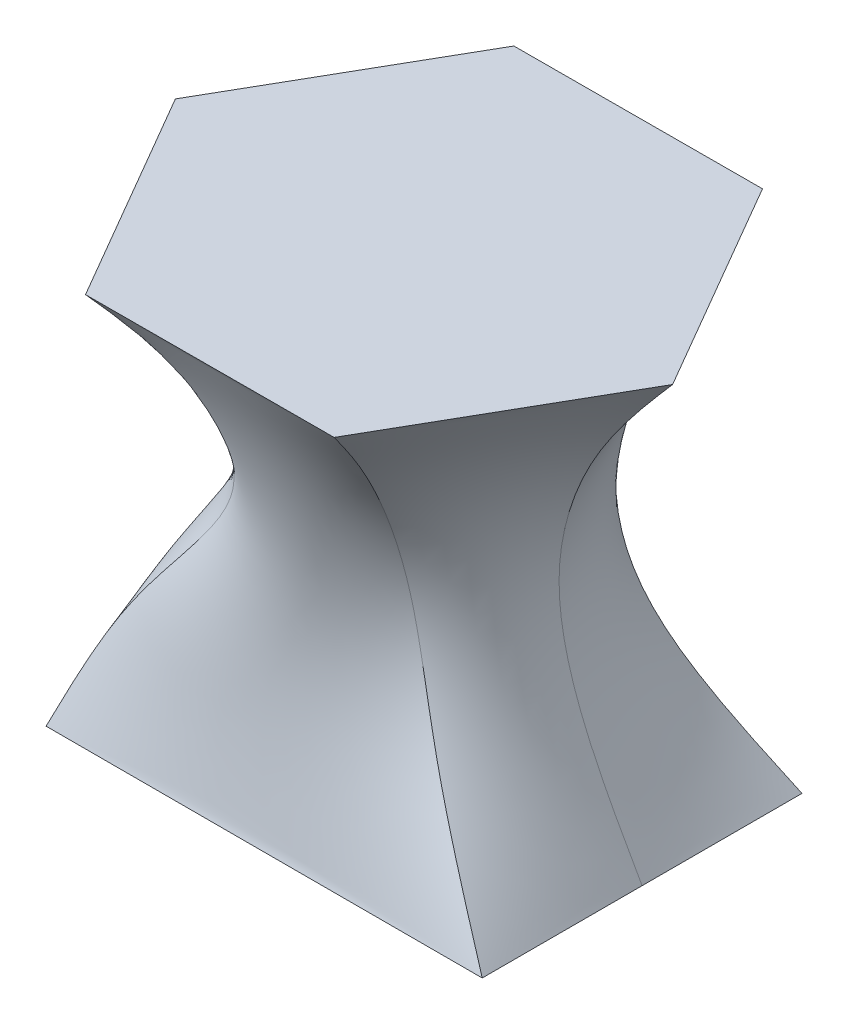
ISO-10303-21;
HEADER;
FILE_DESCRIPTION(('STEP AP214'),'2;1');
FILE_NAME('part.step','',(''),(''),'','','');
FILE_SCHEMA(('AUTOMOTIVE_DESIGN { 1 0 10303 214 1 1 1 1 }'));
ENDSEC;
DATA;
#1=APPLICATION_CONTEXT('core data for automotive mechanical design processes');
#2=APPLICATION_PROTOCOL_DEFINITION('international standard','automotive_design',2000,#1);
#3=PRODUCT_CONTEXT('',#1,'mechanical');
#4=PRODUCT('Part','Part','',(#3));
#5=PRODUCT_RELATED_PRODUCT_CATEGORY('part','',(#4));
#6=PRODUCT_DEFINITION_FORMATION('','',#4);
#7=PRODUCT_DEFINITION_CONTEXT('part definition',#1,'design');
#8=PRODUCT_DEFINITION('design','',#6,#7);
#9=PRODUCT_DEFINITION_SHAPE('','',#8);
#10=(LENGTH_UNIT() NAMED_UNIT(*) SI_UNIT(.MILLI.,.METRE.));
#11=(NAMED_UNIT(*) PLANE_ANGLE_UNIT() SI_UNIT($,.RADIAN.));
#12=(NAMED_UNIT(*) SI_UNIT($,.STERADIAN.) SOLID_ANGLE_UNIT());
#13=UNCERTAINTY_MEASURE_WITH_UNIT(LENGTH_MEASURE(1.E-05),#10,'distance_accuracy_value','');
#14=(GEOMETRIC_REPRESENTATION_CONTEXT(3) GLOBAL_UNCERTAINTY_ASSIGNED_CONTEXT((#13)) GLOBAL_UNIT_ASSIGNED_CONTEXT((#10,
#11,#12)) REPRESENTATION_CONTEXT('',''));
#15=CARTESIAN_POINT('',(0.,0.,0.));
#16=DIRECTION('',(0.,0.,1.));
#17=DIRECTION('',(1.,0.,0.));
#18=AXIS2_PLACEMENT_3D('',#15,#16,#17);
#19=CARTESIAN_POINT('',(-20.631946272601,75.,35.950246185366));
#20=DIRECTION('',(0.,1.,0.));
#21=DIRECTION('',(0.,0.,1.));
#22=AXIS2_PLACEMENT_3D('',#19,#20,#21);
#23=PLANE('',#22);
#24=DIRECTION('',(0.502240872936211,0.,0.864727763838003));
#25=VECTOR('',#24,1.);
#26=CARTESIAN_POINT('',(-41.4497996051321,75.,0.107333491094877));
#27=LINE('',#26,#25);
#28=CARTESIAN_POINT('',(-41.4497996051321,75.,0.107333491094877));
#29=VERTEX_POINT('',#28);
#30=CARTESIAN_POINT('',(-20.631946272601,75.,35.950246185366));
#31=VERTEX_POINT('',#30);
#32=EDGE_CURVE('E130',#29,#31,#27,.T.);
#33=ORIENTED_EDGE('',*,*,#32,.T.);
#34=DIRECTION('',(0.999996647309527,0.,-0.00258947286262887));
#35=VECTOR('',#34,1.);
#36=CARTESIAN_POINT('',(-20.631946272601,75.,35.950246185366));
#37=LINE('',#36,#35);
#38=CARTESIAN_POINT('',(20.8178533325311,75.,35.8429126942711));
#39=VERTEX_POINT('',#38);
#40=EDGE_CURVE('E150',#31,#39,#37,.T.);
#41=ORIENTED_EDGE('',*,*,#40,.T.);
#42=DIRECTION('',(0.497755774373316,0.,-0.867317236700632));
#43=VECTOR('',#42,1.);
#44=CARTESIAN_POINT('',(20.8178533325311,75.,35.8429126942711));
#45=LINE('',#44,#43);
#46=CARTESIAN_POINT('',(41.4497996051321,75.,-0.10733349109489));
#47=VERTEX_POINT('',#46);
#48=EDGE_CURVE('E385',#39,#47,#45,.T.);
#49=ORIENTED_EDGE('',*,*,#48,.T.);
#50=DIRECTION('',(-0.502240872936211,0.,-0.864727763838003));
#51=VECTOR('',#50,1.);
#52=CARTESIAN_POINT('',(41.4497996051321,75.,-0.10733349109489));
#53=LINE('',#52,#51);
#54=CARTESIAN_POINT('',(20.631946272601,75.,-35.950246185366));
#55=VERTEX_POINT('',#54);
#56=EDGE_CURVE('E351',#47,#55,#53,.T.);
#57=ORIENTED_EDGE('',*,*,#56,.T.);
#58=DIRECTION('',(-0.999996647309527,0.,0.0025894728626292));
#59=VECTOR('',#58,1.);
#60=CARTESIAN_POINT('',(20.631946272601,75.,-35.950246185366));
#61=LINE('',#60,#59);
#62=CARTESIAN_POINT('',(-20.8178533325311,75.,-35.8429126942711));
#63=VERTEX_POINT('',#62);
#64=EDGE_CURVE('E132',#55,#63,#61,.T.);
#65=ORIENTED_EDGE('',*,*,#64,.T.);
#66=DIRECTION('',(-0.497755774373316,0.,0.867317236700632));
#67=VECTOR('',#66,1.);
#68=CARTESIAN_POINT('',(-20.8178533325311,75.,-35.8429126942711));
#69=LINE('',#68,#67);
#70=EDGE_CURVE('E126',#63,#29,#69,.T.);
#71=ORIENTED_EDGE('',*,*,#70,.T.);
#72=EDGE_LOOP('',(#33,#41,#49,#57,#65,#71));
#73=FACE_BOUND('',#72,.T.);
#74=ADVANCED_FACE('F71',(#73),#23,.T.);
#75=CARTESIAN_POINT('',(-36.4556820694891,0.,-26.7203578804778));
#76=DIRECTION('',(0.,-1.,0.));
#77=DIRECTION('',(0.,0.,-1.));
#78=AXIS2_PLACEMENT_3D('',#75,#76,#77);
#79=PLANE('',#78);
#80=DIRECTION('',(0.,0.,1.));
#81=VECTOR('',#80,1.);
#82=CARTESIAN_POINT('',(-36.4556820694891,0.,26.7203578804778));
#83=LINE('',#82,#81);
#84=CARTESIAN_POINT('',(-36.4556820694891,0.,-26.7203578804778));
#85=VERTEX_POINT('',#84);
#86=CARTESIAN_POINT('',(-36.4556820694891,0.,0.));
#87=VERTEX_POINT('',#86);
#88=EDGE_CURVE('E156',#85,#87,#83,.T.);
#89=ORIENTED_EDGE('',*,*,#88,.F.);
#90=DIRECTION('',(-1.,0.,0.));
#91=VECTOR('',#90,1.);
#92=CARTESIAN_POINT('',(-36.4556820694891,0.,-26.7203578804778));
#93=LINE('',#92,#91);
#94=CARTESIAN_POINT('',(36.455682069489,0.,-26.7203578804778));
#95=VERTEX_POINT('',#94);
#96=EDGE_CURVE('E283',#95,#85,#93,.T.);
#97=ORIENTED_EDGE('',*,*,#96,.F.);
#98=DIRECTION('',(0.,0.,-1.));
#99=VECTOR('',#98,1.);
#100=CARTESIAN_POINT('',(36.455682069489,0.,26.7203578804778));
#101=LINE('',#100,#99);
#102=CARTESIAN_POINT('',(36.455682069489,0.,0.));
#103=VERTEX_POINT('',#102);
#104=EDGE_CURVE('E370',#103,#95,#101,.T.);
#105=ORIENTED_EDGE('',*,*,#104,.F.);
#106=CARTESIAN_POINT('',(36.455682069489,0.,26.7203578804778));
#107=VERTEX_POINT('',#106);
#108=EDGE_CURVE('E82',#107,#103,#101,.T.);
#109=ORIENTED_EDGE('',*,*,#108,.F.);
#110=DIRECTION('',(1.,0.,0.));
#111=VECTOR('',#110,1.);
#112=CARTESIAN_POINT('',(-36.4556820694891,0.,26.7203578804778));
#113=LINE('',#112,#111);
#114=CARTESIAN_POINT('',(-36.4556820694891,0.,26.7203578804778));
#115=VERTEX_POINT('',#114);
#116=EDGE_CURVE('E13',#115,#107,#113,.T.);
#117=ORIENTED_EDGE('',*,*,#116,.F.);
#118=EDGE_CURVE('E158',#87,#115,#83,.T.);
#119=ORIENTED_EDGE('',*,*,#118,.F.);
#120=EDGE_LOOP('',(#89,#97,#105,#109,#117,#119));
#121=FACE_BOUND('',#120,.T.);
#122=ADVANCED_FACE('F188',(#121),#79,.T.);
#123=CARTESIAN_POINT('',(-36.4556820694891,0.,-26.7203578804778));
#124=CARTESIAN_POINT('',(-34.507799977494,6.04897918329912,-24.291469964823));
#125=CARTESIAN_POINT('',(-32.290578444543,12.9639564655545,-21.5155950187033));
#126=CARTESIAN_POINT('',(-24.2824852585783,25.8944417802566,-17.4862828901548));
#127=CARTESIAN_POINT('',(-17.5366131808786,32.931496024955,-16.2702262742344));
#128=CARTESIAN_POINT('',(-14.8094991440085,40.1748715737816,-17.1580014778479));
#129=CARTESIAN_POINT('',(-13.2899705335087,45.0408187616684,-17.9169780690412));
#130=CARTESIAN_POINT('',(-13.5108838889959,53.1295290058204,-20.5751744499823));
#131=CARTESIAN_POINT('',(-16.8959987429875,64.759420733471,-27.1338146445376));
#132=CARTESIAN_POINT('',(-19.3504307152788,71.1622835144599,-32.5770001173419));
#133=CARTESIAN_POINT('',(-20.8178533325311,75.,-35.8429126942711));
#134=CARTESIAN_POINT('',(-36.4556820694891,0.,-24.493661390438));
#135=CARTESIAN_POINT('',(-34.7740431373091,6.06327115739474,-22.3472097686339));
#136=CARTESIAN_POINT('',(-32.8613807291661,12.9946379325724,-19.8941190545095));
#137=CARTESIAN_POINT('',(-25.2691547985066,25.9252450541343,-16.3437915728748));
#138=CARTESIAN_POINT('',(-18.6416267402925,32.941846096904,-15.2831575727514));
#139=CARTESIAN_POINT('',(-16.0348275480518,40.1745915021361,-16.0952462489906));
#140=CARTESIAN_POINT('',(-14.5956931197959,45.0342045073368,-16.7854821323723));
#141=CARTESIAN_POINT('',(-14.9506102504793,53.1200875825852,-19.1757526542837));
#142=CARTESIAN_POINT('',(-18.5107629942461,64.7676889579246,-25.0526083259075));
#143=CARTESIAN_POINT('',(-21.0306564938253,71.1654271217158,-29.9241390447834));
#144=CARTESIAN_POINT('',(-22.5371821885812,75.,-32.8470588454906));
#145=CARTESIAN_POINT('',(-36.4556820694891,0.,-20.0402684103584));
#146=CARTESIAN_POINT('',(-35.2570538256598,6.09185510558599,-18.4017222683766));
#147=CARTESIAN_POINT('',(-33.8969660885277,13.0560008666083,-16.529094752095));
#148=CARTESIAN_POINT('',(-27.0477336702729,25.9868516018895,-13.8345586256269));
#149=CARTESIAN_POINT('',(-20.6231811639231,32.962546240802,-13.0459527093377));
#150=CARTESIAN_POINT('',(-18.2575338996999,40.1740313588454,-13.7072696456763));
#151=CARTESIAN_POINT('',(-16.9822082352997,45.0209759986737,-14.263501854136));
#152=CARTESIAN_POINT('',(-17.6330385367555,53.1012047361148,-16.1500516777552));
#153=CARTESIAN_POINT('',(-21.6253474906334,64.7842254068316,-20.7578471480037));
#154=CARTESIAN_POINT('',(-24.3480040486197,71.1717143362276,-24.568786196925));
#155=CARTESIAN_POINT('',(-25.9758399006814,75.,-26.8553511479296));
#156=CARTESIAN_POINT('',(-36.4556820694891,0.,-13.3601789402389));
#157=CARTESIAN_POINT('',(-35.8001499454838,6.1347310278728,-12.3478797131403));
#158=CARTESIAN_POINT('',(-35.0615871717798,13.1480452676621,-11.1909626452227));
#159=CARTESIAN_POINT('',(-29.0014447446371,26.0792614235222,-9.53687698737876));
#160=CARTESIAN_POINT('',(-22.7577368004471,32.9935964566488,-9.06390822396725));
#161=CARTESIAN_POINT('',(-20.7557324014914,40.1731911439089,-9.50049899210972));
#162=CARTESIAN_POINT('',(-19.737195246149,45.0011332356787,-9.8640045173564));
#163=CARTESIAN_POINT('',(-20.9342211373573,53.072880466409,-11.0714618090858));
#164=CARTESIAN_POINT('',(-25.8757413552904,64.8090300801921,-14.0006471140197));
#165=CARTESIAN_POINT('',(-29.1659693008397,71.1811451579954,-16.4176100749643));
#166=CARTESIAN_POINT('',(-31.1338264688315,75.0000000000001,-17.8677896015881));
#167=CARTESIAN_POINT('',(-36.4556820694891,0.,-6.68008947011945));
#168=CARTESIAN_POINT('',(-36.1372599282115,6.17760695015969,-6.20009268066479));
#169=CARTESIAN_POINT('',(-35.7848093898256,13.240089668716,-5.65152094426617));
#170=CARTESIAN_POINT('',(-30.1442939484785,26.1716712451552,-4.86938408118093));
#171=CARTESIAN_POINT('',(-23.9410724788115,33.0246466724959,-4.64803909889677));
#172=CARTESIAN_POINT('',(-22.3048852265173,40.1723509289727,-4.86089532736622));
#173=CARTESIAN_POINT('',(-21.5557116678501,44.981290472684,-5.03740931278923));
#174=CARTESIAN_POINT('',(-23.4151150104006,53.0445561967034,-5.61876134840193));
#175=CARTESIAN_POINT('',(-29.6475789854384,64.8338347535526,-7.02519105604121));
#176=CARTESIAN_POINT('',(-33.8044759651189,71.190575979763,-8.18458794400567));
#177=CARTESIAN_POINT('',(-36.2918130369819,75.,-8.88022805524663));
#178=CARTESIAN_POINT('',(-36.4556820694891,0.,-2.22669649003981));
#179=CARTESIAN_POINT('',(-36.2144386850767,6.20619089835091,-2.06951666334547));
#180=CARTESIAN_POINT('',(-35.9507548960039,13.3014526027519,-1.88987839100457));
#181=CARTESIAN_POINT('',(-30.3253204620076,26.2332777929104,-1.63155248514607));
#182=CARTESIAN_POINT('',(-24.0485423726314,33.0453468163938,-1.55611704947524));
#183=CARTESIAN_POINT('',(-22.657790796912,40.1717907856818,-1.62015523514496));
#184=CARTESIAN_POINT('',(-22.097201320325,44.9680619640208,-1.67396487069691));
#185=CARTESIAN_POINT('',(-24.4814182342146,53.025673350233,-1.85599123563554));
#186=CARTESIAN_POINT('',(-31.819316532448,64.8503712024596,-2.3004239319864));
#187=CARTESIAN_POINT('',(-36.7682559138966,71.1968631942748,-2.66798286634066));
#188=CARTESIAN_POINT('',(-39.730470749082,75.,-2.88852035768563));
#189=CARTESIAN_POINT('',(-36.4556820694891,0.,0.));
#190=CARTESIAN_POINT('',(-36.215301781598,6.22048287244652,-0.00422409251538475));
#191=CARTESIAN_POINT('',(-35.9528856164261,13.3321340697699,-0.00904733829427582));
#192=CARTESIAN_POINT('',(-30.2673246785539,26.264081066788,-0.0126187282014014));
#193=CARTESIAN_POINT('',(-23.9280617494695,33.0556968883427,-0.0101349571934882));
#194=CARTESIAN_POINT('',(-22.6604262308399,40.1715107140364,0.000235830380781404));
#195=CARTESIAN_POINT('',(-22.1964319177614,44.9614477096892,0.00777809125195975));
#196=CARTESIAN_POINT('',(-24.8643342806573,53.0162319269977,0.0254119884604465));
#197=CARTESIAN_POINT('',(-32.8175379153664,64.8586394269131,0.0619702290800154));
#198=CARTESIAN_POINT('',(-38.2172781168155,71.2000068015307,0.0903236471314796));
#199=CARTESIAN_POINT('',(-41.4497996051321,75.,0.107333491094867));
#200=B_SPLINE_SURFACE_WITH_KNOTS('',3,3,((#123,#124,#125,#126,#127,#128,#129,#130,#131,#132,
#133),(#134,#135,#136,#137,#138,#139,#140,#141,#142,#143,#144),(#145,#146,#147,#148,#149,#150,
#151,#152,#153,#154,#155),(#156,#157,#158,#159,#160,#161,#162,#163,#164,#165,#166),(#167,#168,
#169,#170,#171,#172,#173,#174,#175,#176,#177),(#178,#179,#180,#181,#182,#183,#184,#185,#186,
#187,#188),(#189,#190,#191,#192,#193,#194,#195,#196,#197,#198,#199)),.UNSPECIFIED.,.F.,.F.,.F.,
(4,1,1,1,4),(4,1,1,1,1,1,1,1,4),(0.727595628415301,0.795696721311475,0.86379781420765,
0.931898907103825,1.),(0.,0.21875,0.25,0.5,0.512214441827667,0.53125,0.6875,0.8125,1.),.UNSPECIFIED.);
#201=CARTESIAN_POINT('',(-36.4556820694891,0.,0.));
#202=CARTESIAN_POINT('',(-36.215301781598,6.22048287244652,-0.00422409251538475));
#203=CARTESIAN_POINT('',(-35.9528856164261,13.3321340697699,-0.00904733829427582));
#204=CARTESIAN_POINT('',(-30.2673246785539,26.264081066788,-0.0126187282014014));
#205=CARTESIAN_POINT('',(-23.9280617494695,33.0556968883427,-0.0101349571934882));
#206=CARTESIAN_POINT('',(-22.6604262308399,40.1715107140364,0.000235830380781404));
#207=CARTESIAN_POINT('',(-22.1964319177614,44.9614477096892,0.00777809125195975));
#208=CARTESIAN_POINT('',(-24.8643342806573,53.0162319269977,0.0254119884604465));
#209=CARTESIAN_POINT('',(-32.8175379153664,64.8586394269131,0.0619702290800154));
#210=CARTESIAN_POINT('',(-38.2172781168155,71.2000068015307,0.0903236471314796));
#211=CARTESIAN_POINT('',(-41.4497996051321,75.,0.107333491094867));
#212=B_SPLINE_CURVE_WITH_KNOTS('',3,(#201,#202,#203,#204,#205,#206,#207,#208,#209,#210,#211),
.UNSPECIFIED.,.F.,.F.,(4,1,1,1,1,1,1,1,4),(0.,0.21875,0.25,0.5,0.512214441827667,0.53125,0.6875,
0.8125,1.),.UNSPECIFIED.);
#213=EDGE_CURVE('E147',#87,#29,#212,.T.);
#214=CARTESIAN_POINT('',(-36.4556820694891,0.,-26.7203578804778));
#215=CARTESIAN_POINT('',(-34.507799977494,6.04897918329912,-24.291469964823));
#216=CARTESIAN_POINT('',(-32.290578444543,12.9639564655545,-21.5155950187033));
#217=CARTESIAN_POINT('',(-24.2824852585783,25.8944417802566,-17.4862828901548));
#218=CARTESIAN_POINT('',(-17.5366131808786,32.931496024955,-16.2702262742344));
#219=CARTESIAN_POINT('',(-14.8094991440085,40.1748715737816,-17.1580014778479));
#220=CARTESIAN_POINT('',(-13.2899705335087,45.0408187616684,-17.9169780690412));
#221=CARTESIAN_POINT('',(-13.5108838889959,53.1295290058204,-20.5751744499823));
#222=CARTESIAN_POINT('',(-16.8959987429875,64.759420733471,-27.1338146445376));
#223=CARTESIAN_POINT('',(-19.3504307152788,71.1622835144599,-32.5770001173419));
#224=CARTESIAN_POINT('',(-20.8178533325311,75.,-35.8429126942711));
#225=B_SPLINE_CURVE_WITH_KNOTS('',3,(#214,#215,#216,#217,#218,#219,#220,#221,#222,#223,#224),
.UNSPECIFIED.,.F.,.F.,(4,1,1,1,1,1,1,1,4),(0.,0.21875,0.25,0.5,0.512214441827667,0.53125,0.6875,
0.8125,1.),.UNSPECIFIED.);
#226=EDGE_CURVE('E120',#85,#63,#225,.T.);
#227=ORIENTED_EDGE('',*,*,#88,.T.);
#228=ORIENTED_EDGE('',*,*,#213,.T.);
#229=ORIENTED_EDGE('',*,*,#70,.F.);
#230=ORIENTED_EDGE('',*,*,#226,.F.);
#231=EDGE_LOOP('',(#227,#228,#229,#230));
#232=FACE_BOUND('',#231,.T.);
#233=ADVANCED_FACE('F154',(#232),#200,.T.);
#234=CARTESIAN_POINT('',(36.455682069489,0.,-26.7203578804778));
#235=CARTESIAN_POINT('',(31.5784609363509,5.76239428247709,-24.2873084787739));
#236=CARTESIAN_POINT('',(26.0012037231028,12.3487268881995,-21.5066796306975));
#237=CARTESIAN_POINT('',(18.1649534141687,25.2767697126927,-17.4738240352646));
#238=CARTESIAN_POINT('',(15.8214730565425,32.7239547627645,-16.2601755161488));
#239=CARTESIAN_POINT('',(14.8571338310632,40.1804876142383,-17.1582355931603));
#240=CARTESIAN_POINT('',(14.3166895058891,45.1734488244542,-17.9246982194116));
#241=CARTESIAN_POINT('',(14.3317059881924,53.318849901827,-20.6004379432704));
#242=CARTESIAN_POINT('',(16.3571643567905,64.5936250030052,-27.1956451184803));
#243=CARTESIAN_POINT('',(19.0278088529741,71.0992474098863,-32.6672709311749));
#244=CARTESIAN_POINT('',(20.631946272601,75.,-35.950246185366));
#245=CARTESIAN_POINT('',(30.3797350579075,0.,-26.7203578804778));
#246=CARTESIAN_POINT('',(26.1663310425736,5.78627635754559,-24.6726982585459));
#247=CARTESIAN_POINT('',(21.3472520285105,12.3999960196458,-22.3325146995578));
#248=CARTESIAN_POINT('',(15.0018635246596,25.3282423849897,-18.990579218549));
#249=CARTESIAN_POINT('',(13.4806016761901,32.741249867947,-18.0390966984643));
#250=CARTESIAN_POINT('',(12.8228801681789,40.1800196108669,-18.9322353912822));
#251=CARTESIAN_POINT('',(12.4482971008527,45.1623963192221,-19.6745679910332));
#252=CARTESIAN_POINT('',(12.3900371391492,53.3030731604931,-22.1316709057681));
#253=CARTESIAN_POINT('',(13.8069116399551,64.6074413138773,-28.0850417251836));
#254=CARTESIAN_POINT('',(15.9124388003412,71.1045004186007,-32.99520429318));
#255=CARTESIAN_POINT('',(17.1777963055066,75.,-35.9413017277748));
#256=CARTESIAN_POINT('',(18.2278410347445,0.,-26.7203578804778));
#257=CARTESIAN_POINT('',(15.2031708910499,5.83404050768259,-25.2833117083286));
#258=CARTESIAN_POINT('',(11.741705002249,12.5025342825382,-23.6409717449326));
#259=CARTESIAN_POINT('',(8.12890418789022,25.4311877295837,-21.3935976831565));
#260=CARTESIAN_POINT('',(8.15743323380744,32.7758400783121,-20.8573106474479));
#261=CARTESIAN_POINT('',(8.11441331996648,40.1790836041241,-21.7422972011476));
#262=CARTESIAN_POINT('',(8.08003238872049,45.1402913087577,-22.4461476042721));
#263=CARTESIAN_POINT('',(7.95356317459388,53.2715196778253,-24.5563150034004));
#264=CARTESIAN_POINT('',(8.38370664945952,64.6350739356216,-29.4917298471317));
#265=CARTESIAN_POINT('',(9.56068636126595,71.1150064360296,-33.5115316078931));
#266=CARTESIAN_POINT('',(10.269496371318,74.9999999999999,-35.9234128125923));
#267=CARTESIAN_POINT('',(0.,0.,-26.7203578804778));
#268=CARTESIAN_POINT('',(-1.46466952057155,5.90568673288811,-25.6025542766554));
#269=CARTESIAN_POINT('',(-3.14468736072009,12.656341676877,-24.3250624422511));
#270=CARTESIAN_POINT('',(-3.0587659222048,25.5856057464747,-22.649311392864));
#271=CARTESIAN_POINT('',(-0.857570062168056,32.8277253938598,-22.3292439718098));
#272=CARTESIAN_POINT('',(0.0238173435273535,40.17767959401,-23.2083005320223));
#273=CARTESIAN_POINT('',(0.5133594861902,45.1071337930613,-23.8908537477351));
#274=CARTESIAN_POINT('',(0.410411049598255,53.2241894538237,-25.8171604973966));
#275=CARTESIAN_POINT('',(-0.269417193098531,64.6765228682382,-30.2155338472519));
#276=CARTESIAN_POINT('',(-0.161310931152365,71.1307654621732,-33.7661870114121));
#277=CARTESIAN_POINT('',(-0.0929535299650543,75.0000000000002,-35.8965794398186));
#278=CARTESIAN_POINT('',(-18.2278410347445,0.,-26.7203578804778));
#279=CARTESIAN_POINT('',(-18.132509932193,5.97733295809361,-25.2853924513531));
#280=CARTESIAN_POINT('',(-18.0310797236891,12.8101490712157,-23.6454294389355));
#281=CARTESIAN_POINT('',(-14.2464360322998,25.7400237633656,-21.3998271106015));
#282=CARTESIAN_POINT('',(-9.87257335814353,32.8796107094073,-20.8623360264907));
#283=CARTESIAN_POINT('',(-8.06677863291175,40.1762755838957,-21.7421801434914));
#284=CARTESIAN_POINT('',(-7.05331341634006,45.0739762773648,-22.4422875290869));
#285=CARTESIAN_POINT('',(-7.13274107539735,53.1768592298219,-24.5436832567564));
#286=CARTESIAN_POINT('',(-8.92254103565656,64.7179718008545,-29.4608146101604));
#287=CARTESIAN_POINT('',(-9.88330822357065,71.1465244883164,-33.4663962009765));
#288=CARTESIAN_POINT('',(-10.4554034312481,74.9999999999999,-35.8697460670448));
#289=CARTESIAN_POINT('',(-30.3797350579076,0.,-26.7203578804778));
#290=CARTESIAN_POINT('',(-29.0956700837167,6.02509710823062,-24.6761661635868));
#291=CARTESIAN_POINT('',(-27.6366267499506,12.9126873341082,-22.3399441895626));
#292=CARTESIAN_POINT('',(-21.1193953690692,25.8429691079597,-19.0009615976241));
#293=CARTESIAN_POINT('',(-15.1957418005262,32.9142009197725,-18.0474723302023));
#294=CARTESIAN_POINT('',(-12.7752454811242,40.175339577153,-18.9320402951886));
#295=CARTESIAN_POINT('',(-11.4215781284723,45.0518712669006,-19.6681345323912));
#296=CARTESIAN_POINT('',(-11.5692150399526,53.1453057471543,-22.1106179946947));
#297=CARTESIAN_POINT('',(-14.3457460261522,64.7456044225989,-28.0335163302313));
#298=CARTESIAN_POINT('',(-16.2350606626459,71.1570305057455,-32.9199786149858));
#299=CARTESIAN_POINT('',(-17.3637033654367,75.,-35.8518571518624));
#300=CARTESIAN_POINT('',(-36.4556820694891,0.,-26.7203578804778));
#301=CARTESIAN_POINT('',(-34.507799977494,6.04897918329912,-24.291469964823));
#302=CARTESIAN_POINT('',(-32.290578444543,12.9639564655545,-21.5155950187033));
#303=CARTESIAN_POINT('',(-24.2824852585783,25.8944417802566,-17.4862828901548));
#304=CARTESIAN_POINT('',(-17.5366131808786,32.931496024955,-16.2702262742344));
#305=CARTESIAN_POINT('',(-14.8094991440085,40.1748715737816,-17.1580014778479));
#306=CARTESIAN_POINT('',(-13.2899705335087,45.0408187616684,-17.9169780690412));
#307=CARTESIAN_POINT('',(-13.5108838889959,53.1295290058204,-20.5751744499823));
#308=CARTESIAN_POINT('',(-16.8959987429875,64.759420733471,-27.1338146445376));
#309=CARTESIAN_POINT('',(-19.3504307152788,71.1622835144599,-32.5770001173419));
#310=CARTESIAN_POINT('',(-20.8178533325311,75.,-35.8429126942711));
#311=B_SPLINE_SURFACE_WITH_KNOTS('',3,3,((#234,#235,#236,#237,#238,#239,#240,#241,#242,#243,
#244),(#245,#246,#247,#248,#249,#250,#251,#252,#253,#254,#255),(#256,#257,#258,#259,#260,#261,
#262,#263,#264,#265,#266),(#267,#268,#269,#270,#271,#272,#273,#274,#275,#276,#277),(#278,#279,
#280,#281,#282,#283,#284,#285,#286,#287,#288),(#289,#290,#291,#292,#293,#294,#295,#296,#297,
#298,#299),(#300,#301,#302,#303,#304,#305,#306,#307,#308,#309,#310)),.UNSPECIFIED.,.F.,.F.,.F.,
(4,1,1,1,4),(4,1,1,1,1,1,1,1,4),(0.272404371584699,0.38620218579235,0.5,0.61379781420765,
0.727595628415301),(0.,0.21875,0.25,0.5,0.512214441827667,0.53125,0.6875,0.8125,1.),.UNSPECIFIED.);
#312=CARTESIAN_POINT('',(36.455682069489,0.,-26.7203578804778));
#313=CARTESIAN_POINT('',(31.5784609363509,5.76239428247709,-24.2873084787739));
#314=CARTESIAN_POINT('',(26.0012037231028,12.3487268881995,-21.5066796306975));
#315=CARTESIAN_POINT('',(18.1649534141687,25.2767697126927,-17.4738240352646));
#316=CARTESIAN_POINT('',(15.8214730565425,32.7239547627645,-16.2601755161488));
#317=CARTESIAN_POINT('',(14.8571338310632,40.1804876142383,-17.1582355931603));
#318=CARTESIAN_POINT('',(14.3166895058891,45.1734488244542,-17.9246982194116));
#319=CARTESIAN_POINT('',(14.3317059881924,53.318849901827,-20.6004379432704));
#320=CARTESIAN_POINT('',(16.3571643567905,64.5936250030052,-27.1956451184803));
#321=CARTESIAN_POINT('',(19.0278088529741,71.0992474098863,-32.6672709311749));
#322=CARTESIAN_POINT('',(20.631946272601,75.,-35.950246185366));
#323=B_SPLINE_CURVE_WITH_KNOTS('',3,(#312,#313,#314,#315,#316,#317,#318,#319,#320,#321,#322),
.UNSPECIFIED.,.F.,.F.,(4,1,1,1,1,1,1,1,4),(0.,0.21875,0.25,0.5,0.512214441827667,0.53125,0.6875,
0.8125,1.),.UNSPECIFIED.);
#324=EDGE_CURVE('E161',#95,#55,#323,.T.);
#325=ORIENTED_EDGE('',*,*,#96,.T.);
#326=ORIENTED_EDGE('',*,*,#226,.T.);
#327=ORIENTED_EDGE('',*,*,#64,.F.);
#328=ORIENTED_EDGE('',*,*,#324,.F.);
#329=EDGE_LOOP('',(#325,#326,#327,#328));
#330=FACE_BOUND('',#329,.T.);
#331=ADVANCED_FACE('F187',(#330),#311,.T.);
#332=CARTESIAN_POINT('',(36.455682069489,0.,0.));
#333=CARTESIAN_POINT('',(33.2788454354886,5.59089059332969,0.00410917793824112));
#334=CARTESIAN_POINT('',(29.6482595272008,11.9805492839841,0.00880509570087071));
#335=CARTESIAN_POINT('',(24.1284462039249,24.9071304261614,0.0123254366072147));
#336=CARTESIAN_POINT('',(22.195674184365,32.5997538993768,0.00998485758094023));
#337=CARTESIAN_POINT('',(22.7084604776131,40.1838484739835,-0.000233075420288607));
#338=CARTESIAN_POINT('',(23.2364316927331,45.2528198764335,-0.00767254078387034));
#339=CARTESIAN_POINT('',(25.7287057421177,53.4321469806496,-0.0251386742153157));
#340=CARTESIAN_POINT('',(32.3855975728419,64.4944063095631,-0.0617133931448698));
#341=CARTESIAN_POINT('',(38.0509334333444,71.0615241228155,-0.0902266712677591));
#342=CARTESIAN_POINT('',(41.4497996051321,75.,-0.10733349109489));
#343=CARTESIAN_POINT('',(36.455682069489,0.,-2.22669649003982));
#344=CARTESIAN_POINT('',(33.2785754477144,5.60518256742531,-2.06153104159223));
#345=CARTESIAN_POINT('',(29.647399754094,12.0112307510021,-1.87277071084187));
#346=CARTESIAN_POINT('',(24.1882208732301,24.937933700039,-1.60764876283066));
#347=CARTESIAN_POINT('',(22.3175920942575,32.6101039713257,-1.53683632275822));
#348=CARTESIAN_POINT('',(22.7057917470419,40.1835684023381,-1.62060457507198));
#349=CARTESIAN_POINT('',(23.1360943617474,45.2462056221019,-1.68877129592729));
#350=CARTESIAN_POINT('',(25.342160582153,53.4227055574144,-1.90443463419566));
#351=CARTESIAN_POINT('',(31.3784683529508,64.5026745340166,-2.41895312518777));
#352=CARTESIAN_POINT('',(36.5888881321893,71.0646677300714,-2.84100989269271));
#353=CARTESIAN_POINT('',(39.7149784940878,75.,-3.09424288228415));
#354=CARTESIAN_POINT('',(36.455682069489,0.,-6.68008947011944));
#355=CARTESIAN_POINT('',(33.2025829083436,5.63376651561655,-6.1928023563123));
#356=CARTESIAN_POINT('',(29.4839961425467,12.072593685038,-5.63590277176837));
#357=CARTESIAN_POINT('',(24.0107521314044,24.9995402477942,-4.84756124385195));
#358=CARTESIAN_POINT('',(22.2129967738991,32.6308041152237,-4.63043654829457));
#359=CARTESIAN_POINT('',(22.3528195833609,40.1830082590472,-4.86130553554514));
#360=CARTESIAN_POINT('',(22.592391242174,45.2329771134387,-5.05092732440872));
#361=CARTESIAN_POINT('',(24.2685991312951,53.403822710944,-5.6629902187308));
#362=CARTESIAN_POINT('',(29.1889151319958,64.5192109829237,-7.13341139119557));
#363=CARTESIAN_POINT('',(33.5990619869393,71.0709549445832,-8.34256838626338));
#364=CARTESIAN_POINT('',(36.2453362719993,75.,-9.06806166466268));
#365=CARTESIAN_POINT('',(36.4556820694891,0.,-13.3601789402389));
#366=CARTESIAN_POINT('',(32.8672522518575,5.67664243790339,-12.341632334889));
#367=CARTESIAN_POINT('',(28.764586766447,12.1646380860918,-11.1775787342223));
#368=CARTESIAN_POINT('',(22.8732395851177,25.091950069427,-9.51817547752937));
#369=CARTESIAN_POINT('',(21.0339729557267,32.6618543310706,-9.0488229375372));
#370=CARTESIAN_POINT('',(20.8035668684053,40.1821680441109,-9.50085050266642));
#371=CARTESIAN_POINT('',(20.770554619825,45.2131343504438,-9.87558990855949));
#372=CARTESIAN_POINT('',(21.7768179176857,53.3754984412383,-11.1093688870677));
#373=CARTESIAN_POINT('',(25.3903539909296,64.5440156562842,-14.0934041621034));
#374=CARTESIAN_POINT('',(28.9214860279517,71.0803857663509,-16.5530206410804));
#375=CARTESIAN_POINT('',(31.0408729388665,75.,-18.0287898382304));
#376=CARTESIAN_POINT('',(36.455682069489,0.,-20.0402684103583));
#377=CARTESIAN_POINT('',(32.3259354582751,5.71951836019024,-18.3965178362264));
#378=CARTESIAN_POINT('',(27.6037785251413,12.2566824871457,-16.5179451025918));
#379=CARTESIAN_POINT('',(20.9248651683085,25.1843598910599,-13.8189784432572));
#380=CARTESIAN_POINT('',(18.903729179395,32.6929045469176,-13.0333846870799));
#381=CARTESIAN_POINT('',(18.3052684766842,40.1813278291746,-13.7075624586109));
#382=CARTESIAN_POINT('',(18.012247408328,45.1932915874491,-14.2731546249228));
#383=CARTESIAN_POINT('',(18.464747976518,53.3471741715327,-16.1816369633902));
#384=CARTESIAN_POINT('',(21.1132366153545,64.5688203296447,-20.8351409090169));
#385=CARTESIAN_POINT('',(24.0644514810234,71.0898165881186,-24.6816268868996));
#386=CARTESIAN_POINT('',(25.8364096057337,75.,-26.9895180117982));
#387=CARTESIAN_POINT('',(36.455682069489,0.,-24.493661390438));
#388=CARTESIAN_POINT('',(31.8441109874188,5.74810230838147,-22.3427006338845));
#389=CARTESIAN_POINT('',(26.5707350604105,12.3180454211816,-19.8844589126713));
#390=CARTESIAN_POINT('',(19.1498440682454,25.2459664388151,-16.3302922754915));
#391=CARTESIAN_POINT('',(16.9250493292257,32.7136046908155,-15.2722677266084));
#392=CARTESIAN_POINT('',(16.0824955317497,40.1807676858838,-16.0954999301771));
#393=CARTESIAN_POINT('',(15.6235188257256,45.1800630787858,-16.7938464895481));
#394=CARTESIAN_POINT('',(15.7750614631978,53.3282913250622,-19.2031234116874));
#395=CARTESIAN_POINT('',(17.9808364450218,64.5853567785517,-25.1195932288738));
#396=CARTESIAN_POINT('',(20.7210577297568,71.0961038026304,-30.0219331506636));
#397=CARTESIAN_POINT('',(22.3667673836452,75.,-32.9633367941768));
#398=CARTESIAN_POINT('',(36.455682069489,0.,-26.7203578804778));
#399=CARTESIAN_POINT('',(31.5784609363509,5.76239428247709,-24.2873084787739));
#400=CARTESIAN_POINT('',(26.0012037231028,12.3487268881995,-21.5066796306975));
#401=CARTESIAN_POINT('',(18.1649534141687,25.2767697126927,-17.4738240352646));
#402=CARTESIAN_POINT('',(15.8214730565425,32.7239547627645,-16.2601755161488));
#403=CARTESIAN_POINT('',(14.8571338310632,40.1804876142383,-17.1582355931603));
#404=CARTESIAN_POINT('',(14.3166895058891,45.1734488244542,-17.9246982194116));
#405=CARTESIAN_POINT('',(14.3317059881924,53.318849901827,-20.6004379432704));
#406=CARTESIAN_POINT('',(16.3571643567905,64.5936250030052,-27.1956451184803));
#407=CARTESIAN_POINT('',(19.0278088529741,71.0992474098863,-32.6672709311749));
#408=CARTESIAN_POINT('',(20.631946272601,75.,-35.950246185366));
#409=B_SPLINE_SURFACE_WITH_KNOTS('',3,3,((#332,#333,#334,#335,#336,#337,#338,#339,#340,#341,
#342),(#343,#344,#345,#346,#347,#348,#349,#350,#351,#352,#353),(#354,#355,#356,#357,#358,#359,
#360,#361,#362,#363,#364),(#365,#366,#367,#368,#369,#370,#371,#372,#373,#374,#375),(#376,#377,
#378,#379,#380,#381,#382,#383,#384,#385,#386),(#387,#388,#389,#390,#391,#392,#393,#394,#395,
#396,#397),(#398,#399,#400,#401,#402,#403,#404,#405,#406,#407,#408)),.UNSPECIFIED.,.F.,.F.,.F.,
(4,1,1,1,4),(4,1,1,1,1,1,1,1,4),(0.,0.0681010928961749,0.13620218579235,0.204303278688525,
0.272404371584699),(0.,0.21875,0.25,0.5,0.512214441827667,0.53125,0.6875,0.8125,1.),.UNSPECIFIED.);
#410=CARTESIAN_POINT('',(36.455682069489,0.,0.));
#411=CARTESIAN_POINT('',(33.2788454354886,5.59089059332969,0.00410917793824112));
#412=CARTESIAN_POINT('',(29.6482595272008,11.9805492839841,0.00880509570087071));
#413=CARTESIAN_POINT('',(24.1284462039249,24.9071304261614,0.0123254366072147));
#414=CARTESIAN_POINT('',(22.195674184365,32.5997538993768,0.00998485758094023));
#415=CARTESIAN_POINT('',(22.7084604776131,40.1838484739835,-0.000233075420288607));
#416=CARTESIAN_POINT('',(23.2364316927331,45.2528198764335,-0.00767254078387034));
#417=CARTESIAN_POINT('',(25.7287057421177,53.4321469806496,-0.0251386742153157));
#418=CARTESIAN_POINT('',(32.3855975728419,64.4944063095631,-0.0617133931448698));
#419=CARTESIAN_POINT('',(38.0509334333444,71.0615241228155,-0.0902266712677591));
#420=CARTESIAN_POINT('',(41.4497996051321,75.,-0.10733349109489));
#421=B_SPLINE_CURVE_WITH_KNOTS('',3,(#410,#411,#412,#413,#414,#415,#416,#417,#418,#419,#420),
.UNSPECIFIED.,.F.,.F.,(4,1,1,1,1,1,1,1,4),(0.,0.21875,0.25,0.5,0.512214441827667,0.53125,0.6875,
0.8125,1.),.UNSPECIFIED.);
#422=EDGE_CURVE('E307',#103,#47,#421,.T.);
#423=ORIENTED_EDGE('',*,*,#104,.T.);
#424=ORIENTED_EDGE('',*,*,#324,.T.);
#425=ORIENTED_EDGE('',*,*,#56,.F.);
#426=ORIENTED_EDGE('',*,*,#422,.F.);
#427=EDGE_LOOP('',(#423,#424,#425,#426));
#428=FACE_BOUND('',#427,.T.);
#429=ADVANCED_FACE('F251',(#428),#409,.T.);
#430=CARTESIAN_POINT('',(36.455682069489,0.,26.7203578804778));
#431=CARTESIAN_POINT('',(31.5713436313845,5.76239428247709,24.2913550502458));
#432=CARTESIAN_POINT('',(25.9859523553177,12.3487268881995,21.5153527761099));
#433=CARTESIAN_POINT('',(18.1436067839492,25.2767697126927,17.4859895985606));
#434=CARTESIAN_POINT('',(15.8042256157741,32.7239547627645,16.2700761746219));
#435=CARTESIAN_POINT('',(14.8575333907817,40.1804876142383,17.1580042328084));
#436=CARTESIAN_POINT('',(14.3299703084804,45.1734488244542,17.9170836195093));
#437=CARTESIAN_POINT('',(14.3752553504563,53.318849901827,20.5754477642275));
#438=CARTESIAN_POINT('',(16.4640584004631,64.5936250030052,27.1340714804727));
#439=CARTESIAN_POINT('',(19.1840860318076,71.0992474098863,32.5770970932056));
#440=CARTESIAN_POINT('',(20.8178533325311,75.,35.8429126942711));
#441=CARTESIAN_POINT('',(36.455682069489,0.,24.493661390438));
#442=CARTESIAN_POINT('',(31.8375867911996,5.74810230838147,22.3470948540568));
#443=CARTESIAN_POINT('',(26.5567546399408,12.3180454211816,19.8938768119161));
#444=CARTESIAN_POINT('',(19.1302763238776,25.2459664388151,16.3434982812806));
#445=CARTESIAN_POINT('',(16.909239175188,32.7136046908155,15.2830074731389));
#446=CARTESIAN_POINT('',(16.082861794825,40.1807676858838,16.0952490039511));
#447=CARTESIAN_POINT('',(15.6356928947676,45.1800630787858,16.7855876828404));
#448=CARTESIAN_POINT('',(15.8149817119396,53.3282913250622,19.1760259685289));
#449=CARTESIAN_POINT('',(18.0788226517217,64.5853567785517,25.0528651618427));
#450=CARTESIAN_POINT('',(20.8643118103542,71.0961038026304,29.9242360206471));
#451=CARTESIAN_POINT('',(22.5371821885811,75.,32.8470588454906));
#452=CARTESIAN_POINT('',(36.455682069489,0.,20.0402684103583));
#453=CARTESIAN_POINT('',(32.3205974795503,5.71951836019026,18.4016073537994));
#454=CARTESIAN_POINT('',(27.5923399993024,12.2566824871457,16.5288525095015));
#455=CARTESIAN_POINT('',(20.9088551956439,25.18435989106,13.8342653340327));
#456=CARTESIAN_POINT('',(18.8907935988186,32.6929045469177,13.0458026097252));
#457=CARTESIAN_POINT('',(18.305568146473,40.1813278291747,13.7072724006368));
#458=CARTESIAN_POINT('',(18.0222080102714,45.1932915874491,14.2636074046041));
#459=CARTESIAN_POINT('',(18.4974099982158,53.3471741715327,16.1503249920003));
#460=CARTESIAN_POINT('',(21.193407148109,64.5688203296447,20.7581039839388));
#461=CARTESIAN_POINT('',(24.1816593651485,71.0898165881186,24.5688831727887));
#462=CARTESIAN_POINT('',(25.9758399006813,75.,26.8553511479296));
#463=CARTESIAN_POINT('',(36.4556820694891,0.,13.3601789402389));
#464=CARTESIAN_POINT('',(32.8636935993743,5.67664243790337,12.3477647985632));
#465=CARTESIAN_POINT('',(28.7569610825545,12.1646380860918,11.1907204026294));
#466=CARTESIAN_POINT('',(22.8625662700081,25.091950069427,9.5365836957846));
#467=CARTESIAN_POINT('',(21.0253492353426,32.6618543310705,9.06375812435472));
#468=CARTESIAN_POINT('',(20.8037666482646,40.1821680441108,9.50050174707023));
#469=CARTESIAN_POINT('',(20.7771950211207,45.2131343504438,9.86411006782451));
#470=CARTESIAN_POINT('',(21.7985925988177,53.3754984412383,11.071735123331));
#471=CARTESIAN_POINT('',(25.443801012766,64.5440156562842,14.0009039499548));
#472=CARTESIAN_POINT('',(28.9996246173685,71.0803857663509,16.417707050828));
#473=CARTESIAN_POINT('',(31.1338264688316,75.0000000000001,17.8677896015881));
#474=CARTESIAN_POINT('',(36.455682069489,0.,6.68008947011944));
#475=CARTESIAN_POINT('',(33.200803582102,5.63376651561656,6.19997776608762));
#476=CARTESIAN_POINT('',(29.4801833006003,12.072593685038,5.65127870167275));
#477=CARTESIAN_POINT('',(24.0054154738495,24.9995402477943,4.86909078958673));
#478=CARTESIAN_POINT('',(22.208684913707,32.6308041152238,4.64788899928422));
#479=CARTESIAN_POINT('',(22.3529194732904,40.1830082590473,4.8608980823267));
#480=CARTESIAN_POINT('',(22.5957114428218,45.2329771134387,5.03751486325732));
#481=CARTESIAN_POINT('',(24.279486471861,53.403822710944,5.61903466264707));
#482=CARTESIAN_POINT('',(29.215638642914,64.5192109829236,7.02544789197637));
#483=CARTESIAN_POINT('',(33.6381312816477,71.0709549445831,8.18468491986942));
#484=CARTESIAN_POINT('',(36.2918130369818,74.9999999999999,8.88022805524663));
#485=CARTESIAN_POINT('',(36.455682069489,0.,2.22669649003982));
#486=CARTESIAN_POINT('',(33.2779823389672,5.60518256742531,2.06940174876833));
#487=CARTESIAN_POINT('',(29.6461288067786,12.0112307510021,1.88963614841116));
#488=CARTESIAN_POINT('',(24.1864419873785,24.937933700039,1.63125919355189));
#489=CARTESIAN_POINT('',(22.3161548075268,32.6101039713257,1.5559669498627));
#490=CARTESIAN_POINT('',(22.7058250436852,40.1835684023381,1.62015799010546));
#491=CARTESIAN_POINT('',(23.1372010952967,45.2462056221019,1.67407042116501));
#492=CARTESIAN_POINT('',(25.345789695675,53.4227055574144,1.85626454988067));
#493=CARTESIAN_POINT('',(31.3873761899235,64.5026745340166,2.30068076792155));
#494=CARTESIAN_POINT('',(36.6019112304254,71.0646677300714,2.66807984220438));
#495=CARTESIAN_POINT('',(39.730470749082,75.,2.88852035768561));
#496=CARTESIAN_POINT('',(36.455682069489,0.,0.));
#497=CARTESIAN_POINT('',(33.2788454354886,5.59089059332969,0.00410917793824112));
#498=CARTESIAN_POINT('',(29.6482595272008,11.9805492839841,0.00880509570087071));
#499=CARTESIAN_POINT('',(24.1284462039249,24.9071304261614,0.0123254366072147));
#500=CARTESIAN_POINT('',(22.195674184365,32.5997538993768,0.00998485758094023));
#501=CARTESIAN_POINT('',(22.7084604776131,40.1838484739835,-0.000233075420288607));
#502=CARTESIAN_POINT('',(23.2364316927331,45.2528198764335,-0.00767254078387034));
#503=CARTESIAN_POINT('',(25.7287057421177,53.4321469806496,-0.0251386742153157));
#504=CARTESIAN_POINT('',(32.3855975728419,64.4944063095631,-0.0617133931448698));
#505=CARTESIAN_POINT('',(38.0509334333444,71.0615241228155,-0.0902266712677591));
#506=CARTESIAN_POINT('',(41.4497996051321,75.,-0.107333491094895));
#507=B_SPLINE_SURFACE_WITH_KNOTS('',3,3,((#430,#431,#432,#433,#434,#435,#436,#437,#438,#439,
#440),(#441,#442,#443,#444,#445,#446,#447,#448,#449,#450,#451),(#452,#453,#454,#455,#456,#457,
#458,#459,#460,#461,#462),(#463,#464,#465,#466,#467,#468,#469,#470,#471,#472,#473),(#474,#475,
#476,#477,#478,#479,#480,#481,#482,#483,#484),(#485,#486,#487,#488,#489,#490,#491,#492,#493,
#494,#495),(#496,#497,#498,#499,#500,#501,#502,#503,#504,#505,#506)),.UNSPECIFIED.,.F.,.F.,.F.,
(4,1,1,1,4),(4,1,1,1,1,1,1,1,4),(0.7275956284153,0.795696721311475,0.86379781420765,
0.931898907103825,1.),(0.,0.21875,0.25,0.5,0.512214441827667,0.53125,0.6875,0.8125,1.),.UNSPECIFIED.);
#508=CARTESIAN_POINT('',(36.455682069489,0.,26.7203578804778));
#509=CARTESIAN_POINT('',(31.5713436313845,5.76239428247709,24.2913550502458));
#510=CARTESIAN_POINT('',(25.9859523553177,12.3487268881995,21.5153527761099));
#511=CARTESIAN_POINT('',(18.1436067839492,25.2767697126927,17.4859895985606));
#512=CARTESIAN_POINT('',(15.8042256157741,32.7239547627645,16.2700761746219));
#513=CARTESIAN_POINT('',(14.8575333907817,40.1804876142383,17.1580042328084));
#514=CARTESIAN_POINT('',(14.3299703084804,45.1734488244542,17.9170836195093));
#515=CARTESIAN_POINT('',(14.3752553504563,53.318849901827,20.5754477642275));
#516=CARTESIAN_POINT('',(16.4640584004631,64.5936250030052,27.1340714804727));
#517=CARTESIAN_POINT('',(19.1840860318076,71.0992474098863,32.5770970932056));
#518=CARTESIAN_POINT('',(20.8178533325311,75.,35.8429126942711));
#519=B_SPLINE_CURVE_WITH_KNOTS('',3,(#508,#509,#510,#511,#512,#513,#514,#515,#516,#517,#518),
.UNSPECIFIED.,.F.,.F.,(4,1,1,1,1,1,1,1,4),(0.,0.21875,0.25,0.5,0.512214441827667,0.53125,0.6875,
0.8125,1.),.UNSPECIFIED.);
#520=EDGE_CURVE('E91',#107,#39,#519,.T.);
#521=ORIENTED_EDGE('',*,*,#108,.T.);
#522=ORIENTED_EDGE('',*,*,#422,.T.);
#523=ORIENTED_EDGE('',*,*,#48,.F.);
#524=ORIENTED_EDGE('',*,*,#520,.F.);
#525=EDGE_LOOP('',(#521,#522,#523,#524));
#526=FACE_BOUND('',#525,.T.);
#527=ADVANCED_FACE('F250',(#526),#507,.T.);
#528=CARTESIAN_POINT('',(-36.4556820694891,0.,26.7203578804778));
#529=CARTESIAN_POINT('',(-34.5149172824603,6.04897918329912,24.2871935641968));
#530=CARTESIAN_POINT('',(-32.3058298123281,12.9639564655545,21.5064373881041));
#531=CARTESIAN_POINT('',(-24.3038318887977,25.8944417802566,17.4735307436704));
#532=CARTESIAN_POINT('',(-17.5538606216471,32.931496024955,16.2600254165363));
#533=CARTESIAN_POINT('',(-14.8090995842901,40.1748715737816,17.1582383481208));
#534=CARTESIAN_POINT('',(-13.2766897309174,45.0408187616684,17.9248037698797));
#535=CARTESIAN_POINT('',(-13.4673345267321,53.1295290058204,20.6007112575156));
#536=CARTESIAN_POINT('',(-16.7891046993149,64.759420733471,27.1959019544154));
#537=CARTESIAN_POINT('',(-19.1941535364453,71.1622835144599,32.6673679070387));
#538=CARTESIAN_POINT('',(-20.631946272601,75.,35.950246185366));
#539=CARTESIAN_POINT('',(-30.3797350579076,0.,26.7203578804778));
#540=CARTESIAN_POINT('',(-29.1027873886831,6.02509710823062,24.6725833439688));
#541=CARTESIAN_POINT('',(-27.6518781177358,12.9126873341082,22.3322724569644));
#542=CARTESIAN_POINT('',(-21.1407419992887,25.8429691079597,18.9902859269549));
#543=CARTESIAN_POINT('',(-15.2129892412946,32.9142009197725,18.0389465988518));
#544=CARTESIAN_POINT('',(-12.7748459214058,40.175339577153,18.9322381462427));
#545=CARTESIAN_POINT('',(-11.408297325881,45.0518712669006,19.6746735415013));
#546=CARTESIAN_POINT('',(-11.5256656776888,53.1453057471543,22.1319442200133));
#547=CARTESIAN_POINT('',(-14.2388519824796,64.7456044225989,28.0852985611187));
#548=CARTESIAN_POINT('',(-16.0787834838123,71.1570305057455,32.9953012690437));
#549=CARTESIAN_POINT('',(-17.1777963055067,75.,35.9413017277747));
#550=CARTESIAN_POINT('',(-18.2278410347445,0.,26.7203578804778));
#551=CARTESIAN_POINT('',(-18.1396272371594,5.97733295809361,25.2831967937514));
#552=CARTESIAN_POINT('',(-18.0463310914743,12.8101490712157,23.6407295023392));
#553=CARTESIAN_POINT('',(-14.2677826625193,25.7400237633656,21.3933043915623));
#554=CARTESIAN_POINT('',(-9.88982079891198,32.8796107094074,20.8571605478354));
#555=CARTESIAN_POINT('',(-8.06637907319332,40.1762755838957,21.7422999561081));
#556=CARTESIAN_POINT('',(-7.04003261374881,45.0739762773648,22.4462531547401));
#557=CARTESIAN_POINT('',(-7.08919171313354,53.176859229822,24.5565883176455));
#558=CARTESIAN_POINT('',(-8.81564699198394,64.7179718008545,29.4919866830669));
#559=CARTESIAN_POINT('',(-9.72703104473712,71.1465244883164,33.5116285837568));
#560=CARTESIAN_POINT('',(-10.269496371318,75.,35.9234128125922));
#561=CARTESIAN_POINT('',(0.,0.,26.7203578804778));
#562=CARTESIAN_POINT('',(-1.47178682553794,5.9056867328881,25.6024393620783));
#563=CARTESIAN_POINT('',(-3.15993872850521,12.656341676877,24.3248201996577));
#564=CARTESIAN_POINT('',(-3.08011255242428,25.5856057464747,22.6490181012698));
#565=CARTESIAN_POINT('',(-0.874817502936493,32.8277253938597,22.3290938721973));
#566=CARTESIAN_POINT('',(0.024216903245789,40.1776795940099,23.2083032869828));
#567=CARTESIAN_POINT('',(0.526640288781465,45.1071337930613,23.8909592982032));
#568=CARTESIAN_POINT('',(0.45396041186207,53.2241894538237,25.8174338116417));
#569=CARTESIAN_POINT('',(-0.162523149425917,64.6765228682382,30.2157906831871));
#570=CARTESIAN_POINT('',(-0.00503375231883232,71.1307654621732,33.7662839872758));
#571=CARTESIAN_POINT('',(0.0929535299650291,75.0000000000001,35.8965794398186));
#572=CARTESIAN_POINT('',(18.2278410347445,0.,26.7203578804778));
#573=CARTESIAN_POINT('',(15.1960535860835,5.8340405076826,25.2852775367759));
#574=CARTESIAN_POINT('',(11.7264536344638,12.5025342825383,23.6451871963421));
#575=CARTESIAN_POINT('',(8.10755755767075,25.4311877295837,21.3995338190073));
#576=CARTESIAN_POINT('',(8.14018579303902,32.7758400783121,20.8621859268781));
#577=CARTESIAN_POINT('',(8.11481287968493,40.1790836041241,21.7421828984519));
#578=CARTESIAN_POINT('',(8.09331319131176,45.1402913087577,22.4423930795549));
#579=CARTESIAN_POINT('',(7.99711253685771,53.2715196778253,24.5439565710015));
#580=CARTESIAN_POINT('',(8.49060069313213,64.6350739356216,29.4610714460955));
#581=CARTESIAN_POINT('',(9.71696354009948,71.1150064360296,33.4664931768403));
#582=CARTESIAN_POINT('',(10.455403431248,74.9999999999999,35.8697460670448));
#583=CARTESIAN_POINT('',(30.3797350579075,0.,26.7203578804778));
#584=CARTESIAN_POINT('',(26.1592137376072,5.78627635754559,24.6760512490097));
#585=CARTESIAN_POINT('',(21.3320006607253,12.3999960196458,22.3397019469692));
#586=CARTESIAN_POINT('',(14.9805168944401,25.3282423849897,19.00066830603));
#587=CARTESIAN_POINT('',(13.4633542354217,32.741249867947,18.0473222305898));
#588=CARTESIAN_POINT('',(12.8232797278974,40.1800196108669,18.9320430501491));
#589=CARTESIAN_POINT('',(12.461577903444,45.1623963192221,19.6682400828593));
#590=CARTESIAN_POINT('',(12.433586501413,53.3030731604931,22.1108913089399));
#591=CARTESIAN_POINT('',(13.9138056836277,64.6074413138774,28.0337731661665));
#592=CARTESIAN_POINT('',(16.0687159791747,71.1045004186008,32.9200755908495));
#593=CARTESIAN_POINT('',(17.3637033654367,75.,35.8518571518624));
#594=CARTESIAN_POINT('',(36.455682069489,0.,26.7203578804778));
#595=CARTESIAN_POINT('',(31.5713436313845,5.76239428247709,24.2913550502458));
#596=CARTESIAN_POINT('',(25.9859523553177,12.3487268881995,21.5153527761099));
#597=CARTESIAN_POINT('',(18.1436067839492,25.2767697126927,17.4859895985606));
#598=CARTESIAN_POINT('',(15.8042256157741,32.7239547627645,16.2700761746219));
#599=CARTESIAN_POINT('',(14.8575333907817,40.1804876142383,17.1580042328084));
#600=CARTESIAN_POINT('',(14.3299703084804,45.1734488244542,17.9170836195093));
#601=CARTESIAN_POINT('',(14.3752553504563,53.318849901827,20.5754477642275));
#602=CARTESIAN_POINT('',(16.4640584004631,64.5936250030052,27.1340714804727));
#603=CARTESIAN_POINT('',(19.1840860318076,71.0992474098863,32.5770970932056));
#604=CARTESIAN_POINT('',(20.8178533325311,75.,35.8429126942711));
#605=B_SPLINE_SURFACE_WITH_KNOTS('',3,3,((#528,#529,#530,#531,#532,#533,#534,#535,#536,#537,
#538),(#539,#540,#541,#542,#543,#544,#545,#546,#547,#548,#549),(#550,#551,#552,#553,#554,#555,
#556,#557,#558,#559,#560),(#561,#562,#563,#564,#565,#566,#567,#568,#569,#570,#571),(#572,#573,
#574,#575,#576,#577,#578,#579,#580,#581,#582),(#583,#584,#585,#586,#587,#588,#589,#590,#591,
#592,#593),(#594,#595,#596,#597,#598,#599,#600,#601,#602,#603,#604)),.UNSPECIFIED.,.F.,.F.,.F.,
(4,1,1,1,4),(4,1,1,1,1,1,1,1,4),(0.2724043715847,0.38620218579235,0.5,0.61379781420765,
0.7275956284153),(0.,0.21875,0.25,0.5,0.512214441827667,0.53125,0.6875,0.8125,1.),.UNSPECIFIED.);
#606=CARTESIAN_POINT('',(-36.4556820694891,0.,26.7203578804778));
#607=CARTESIAN_POINT('',(-34.5149172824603,6.04897918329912,24.2871935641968));
#608=CARTESIAN_POINT('',(-32.3058298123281,12.9639564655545,21.5064373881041));
#609=CARTESIAN_POINT('',(-24.3038318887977,25.8944417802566,17.4735307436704));
#610=CARTESIAN_POINT('',(-17.5538606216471,32.931496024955,16.2600254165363));
#611=CARTESIAN_POINT('',(-14.8090995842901,40.1748715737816,17.1582383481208));
#612=CARTESIAN_POINT('',(-13.2766897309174,45.0408187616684,17.9248037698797));
#613=CARTESIAN_POINT('',(-13.4673345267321,53.1295290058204,20.6007112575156));
#614=CARTESIAN_POINT('',(-16.7891046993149,64.759420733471,27.1959019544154));
#615=CARTESIAN_POINT('',(-19.1941535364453,71.1622835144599,32.6673679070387));
#616=CARTESIAN_POINT('',(-20.631946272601,75.,35.950246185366));
#617=B_SPLINE_CURVE_WITH_KNOTS('',3,(#606,#607,#608,#609,#610,#611,#612,#613,#614,#615,#616),
.UNSPECIFIED.,.F.,.F.,(4,1,1,1,1,1,1,1,4),(0.,0.21875,0.25,0.5,0.512214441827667,0.53125,0.6875,
0.8125,1.),.UNSPECIFIED.);
#618=EDGE_CURVE('E137',#115,#31,#617,.T.);
#619=ORIENTED_EDGE('',*,*,#116,.T.);
#620=ORIENTED_EDGE('',*,*,#520,.T.);
#621=ORIENTED_EDGE('',*,*,#40,.F.);
#622=ORIENTED_EDGE('',*,*,#618,.F.);
#623=EDGE_LOOP('',(#619,#620,#621,#622));
#624=FACE_BOUND('',#623,.T.);
#625=ADVANCED_FACE('F204',(#624),#605,.T.);
#626=CARTESIAN_POINT('',(-36.4556820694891,0.,0.));
#627=CARTESIAN_POINT('',(-36.215301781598,6.22048287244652,-0.00422409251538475));
#628=CARTESIAN_POINT('',(-35.9528856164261,13.3321340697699,-0.00904733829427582));
#629=CARTESIAN_POINT('',(-30.2673246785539,26.264081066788,-0.0126187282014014));
#630=CARTESIAN_POINT('',(-23.9280617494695,33.0556968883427,-0.0101349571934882));
#631=CARTESIAN_POINT('',(-22.6604262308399,40.1715107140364,0.000235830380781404));
#632=CARTESIAN_POINT('',(-22.1964319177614,44.9614477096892,0.00777809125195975));
#633=CARTESIAN_POINT('',(-24.8643342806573,53.0162319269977,0.0254119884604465));
#634=CARTESIAN_POINT('',(-32.8175379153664,64.8586394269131,0.0619702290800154));
#635=CARTESIAN_POINT('',(-38.2172781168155,71.2000068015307,0.0903236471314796));
#636=CARTESIAN_POINT('',(-41.4497996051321,75.,0.107333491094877));
#637=CARTESIAN_POINT('',(-36.4556820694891,0.,2.22669649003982));
#638=CARTESIAN_POINT('',(-36.2150317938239,6.20619089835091,2.06141612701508));
#639=CARTESIAN_POINT('',(-35.9520258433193,13.3014526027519,1.87252846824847));
#640=CARTESIAN_POINT('',(-30.3270993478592,26.2332777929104,1.60735547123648));
#641=CARTESIAN_POINT('',(-24.0499796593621,33.0453468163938,1.53668622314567));
#642=CARTESIAN_POINT('',(-22.6577575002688,40.1717907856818,1.62060733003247));
#643=CARTESIAN_POINT('',(-22.0960945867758,44.9680619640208,1.68887684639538));
#644=CARTESIAN_POINT('',(-24.4777891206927,53.025673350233,1.90470794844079));
#645=CARTESIAN_POINT('',(-31.8104086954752,64.8503712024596,2.41920996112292));
#646=CARTESIAN_POINT('',(-36.7552328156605,71.1968631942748,2.84110686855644));
#647=CARTESIAN_POINT('',(-39.7149784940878,75.,3.09424288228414));
#648=CARTESIAN_POINT('',(-36.455682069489,0.,6.68008947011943));
#649=CARTESIAN_POINT('',(-36.139039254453,6.17760695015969,6.19268744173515));
#650=CARTESIAN_POINT('',(-35.7886222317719,13.240089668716,5.63566052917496));
#651=CARTESIAN_POINT('',(-30.1496306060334,26.1716712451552,4.84726795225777));
#652=CARTESIAN_POINT('',(-23.9453843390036,33.0246466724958,4.63028644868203));
#653=CARTESIAN_POINT('',(-22.3047853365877,40.1723509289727,4.86130829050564));
#654=CARTESIAN_POINT('',(-21.5523914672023,44.981290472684,5.05103287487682));
#655=CARTESIAN_POINT('',(-23.4042276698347,53.0445561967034,5.66326353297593));
#656=CARTESIAN_POINT('',(-29.6208554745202,64.8338347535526,7.13366822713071));
#657=CARTESIAN_POINT('',(-33.7654066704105,71.190575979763,8.34266536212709));
#658=CARTESIAN_POINT('',(-36.2453362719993,75.,9.06806166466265));
#659=CARTESIAN_POINT('',(-36.4556820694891,0.,13.3601789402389));
#660=CARTESIAN_POINT('',(-35.803708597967,6.1347310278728,12.3415174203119));
#661=CARTESIAN_POINT('',(-35.0692128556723,13.1480452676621,11.1773364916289));
#662=CARTESIAN_POINT('',(-29.0121180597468,26.0792614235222,9.51788218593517));
#663=CARTESIAN_POINT('',(-22.7663605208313,32.9935964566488,9.04867283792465));
#664=CARTESIAN_POINT('',(-20.7555326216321,40.1731911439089,9.50085325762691));
#665=CARTESIAN_POINT('',(-19.7305548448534,45.0011332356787,9.87569545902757));
#666=CARTESIAN_POINT('',(-20.9124464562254,53.072880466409,11.1096422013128));
#667=CARTESIAN_POINT('',(-25.8222943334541,64.8090300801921,14.0936609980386));
#668=CARTESIAN_POINT('',(-29.087830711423,71.1811451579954,16.5531176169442));
#669=CARTESIAN_POINT('',(-31.0408729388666,75.0000000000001,18.0287898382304));
#670=CARTESIAN_POINT('',(-36.455682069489,0.,20.0402684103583));
#671=CARTESIAN_POINT('',(-35.2623918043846,6.09185510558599,18.3964029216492));
#672=CARTESIAN_POINT('',(-33.9084046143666,13.0560008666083,16.5177028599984));
#673=CARTESIAN_POINT('',(-27.0637436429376,25.9868516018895,13.818685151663));
#674=CARTESIAN_POINT('',(-20.6361167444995,32.962546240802,13.0332345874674));
#675=CARTESIAN_POINT('',(-18.2572342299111,40.1740313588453,13.7075652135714));
#676=CARTESIAN_POINT('',(-16.9722476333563,45.0209759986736,14.2732601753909));
#677=CARTESIAN_POINT('',(-17.6003765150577,53.1012047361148,16.1819102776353));
#678=CARTESIAN_POINT('',(-21.5451769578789,64.7842254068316,20.8353977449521));
#679=CARTESIAN_POINT('',(-24.2307961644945,71.1717143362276,24.6817238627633));
#680=CARTESIAN_POINT('',(-25.8364096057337,75.,26.9895180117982));
#681=CARTESIAN_POINT('',(-36.4556820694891,0.,24.493661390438));
#682=CARTESIAN_POINT('',(-34.7805673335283,6.06327115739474,22.3425857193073));
#683=CARTESIAN_POINT('',(-32.8753611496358,12.9946379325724,19.8842166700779));
#684=CARTESIAN_POINT('',(-25.2887225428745,25.9252450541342,16.3299989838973));
#685=CARTESIAN_POINT('',(-18.6574368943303,32.941846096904,15.2721176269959));
#686=CARTESIAN_POINT('',(-16.0344612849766,40.1745915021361,16.0955026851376));
#687=CARTESIAN_POINT('',(-14.5835190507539,45.0342045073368,16.7939520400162));
#688=CARTESIAN_POINT('',(-14.9106900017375,53.1200875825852,19.2033967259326));
#689=CARTESIAN_POINT('',(-18.4127767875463,64.7676889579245,25.1198500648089));
#690=CARTESIAN_POINT('',(-20.8874024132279,71.1654271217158,30.0220301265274));
#691=CARTESIAN_POINT('',(-22.3667673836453,75.,32.9633367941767));
#692=CARTESIAN_POINT('',(-36.4556820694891,0.,26.7203578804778));
#693=CARTESIAN_POINT('',(-34.5149172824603,6.04897918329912,24.2871935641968));
#694=CARTESIAN_POINT('',(-32.3058298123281,12.9639564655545,21.5064373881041));
#695=CARTESIAN_POINT('',(-24.3038318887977,25.8944417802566,17.4735307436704));
#696=CARTESIAN_POINT('',(-17.5538606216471,32.931496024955,16.2600254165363));
#697=CARTESIAN_POINT('',(-14.8090995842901,40.1748715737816,17.1582383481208));
#698=CARTESIAN_POINT('',(-13.2766897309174,45.0408187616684,17.9248037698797));
#699=CARTESIAN_POINT('',(-13.4673345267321,53.1295290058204,20.6007112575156));
#700=CARTESIAN_POINT('',(-16.7891046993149,64.759420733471,27.1959019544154));
#701=CARTESIAN_POINT('',(-19.1941535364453,71.1622835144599,32.6673679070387));
#702=CARTESIAN_POINT('',(-20.631946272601,75.,35.950246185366));
#703=B_SPLINE_SURFACE_WITH_KNOTS('',3,3,((#626,#627,#628,#629,#630,#631,#632,#633,#634,#635,
#636),(#637,#638,#639,#640,#641,#642,#643,#644,#645,#646,#647),(#648,#649,#650,#651,#652,#653,
#654,#655,#656,#657,#658),(#659,#660,#661,#662,#663,#664,#665,#666,#667,#668,#669),(#670,#671,
#672,#673,#674,#675,#676,#677,#678,#679,#680),(#681,#682,#683,#684,#685,#686,#687,#688,#689,
#690,#691),(#692,#693,#694,#695,#696,#697,#698,#699,#700,#701,#702)),.UNSPECIFIED.,.F.,.F.,.F.,
(4,1,1,1,4),(4,1,1,1,1,1,1,1,4),(0.,0.0681010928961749,0.13620218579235,0.204303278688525,
0.2724043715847),(0.,0.21875,0.25,0.5,0.512214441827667,0.53125,0.6875,0.8125,1.),.UNSPECIFIED.);
#704=ORIENTED_EDGE('',*,*,#118,.T.);
#705=ORIENTED_EDGE('',*,*,#618,.T.);
#706=ORIENTED_EDGE('',*,*,#32,.F.);
#707=ORIENTED_EDGE('',*,*,#213,.F.);
#708=EDGE_LOOP('',(#704,#705,#706,#707));
#709=FACE_BOUND('',#708,.T.);
#710=ADVANCED_FACE('F146',(#709),#703,.T.);
#711=CLOSED_SHELL('',(#74,#122,#233,#331,#429,#527,#625,#710));
#712=MANIFOLD_SOLID_BREP('B2',#711);
#713=ADVANCED_BREP_SHAPE_REPRESENTATION('',(#18,#712),#14);
#714=SHAPE_DEFINITION_REPRESENTATION(#9,#713);
ENDSEC;
END-ISO-10303-21;
